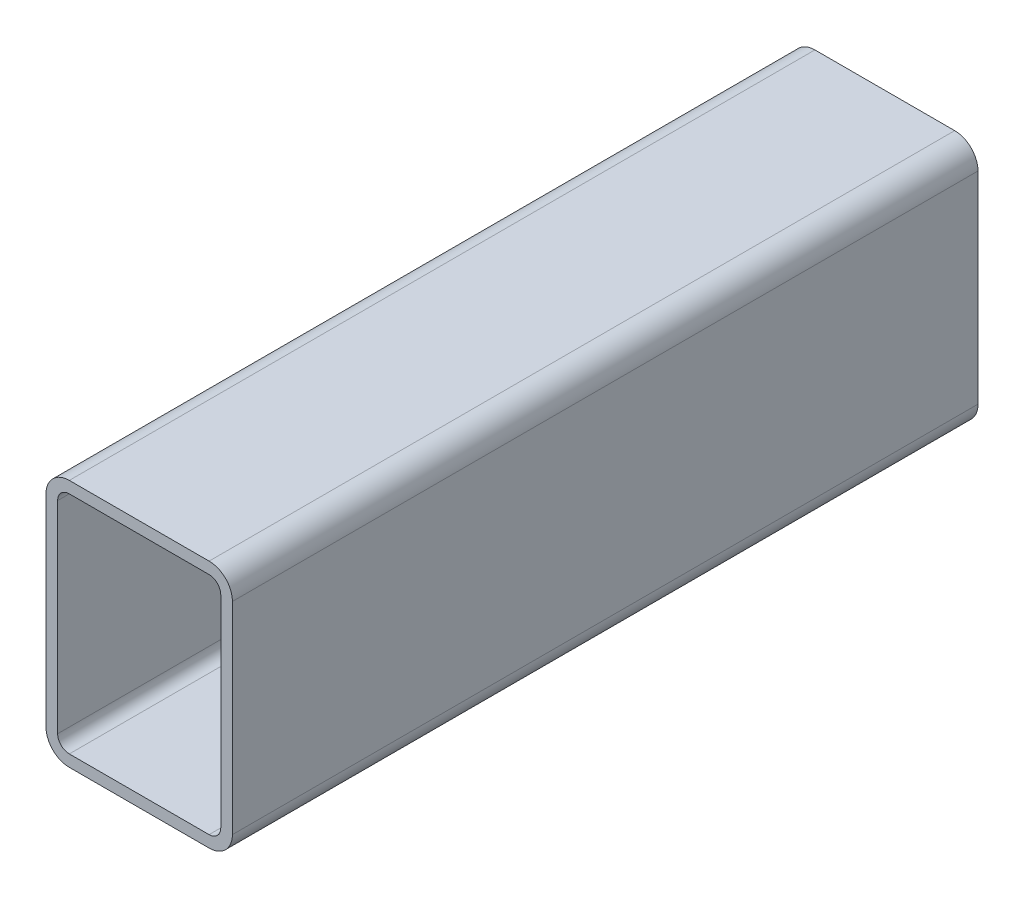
ISO-10303-21;
HEADER;
FILE_DESCRIPTION(('STEP AP214'),'2;1');
FILE_NAME('part.step','',(''),(''),'','','');
FILE_SCHEMA(('AUTOMOTIVE_DESIGN { 1 0 10303 214 1 1 1 1 }'));
ENDSEC;
DATA;
#1=APPLICATION_CONTEXT('core data for automotive mechanical design processes');
#2=APPLICATION_PROTOCOL_DEFINITION('international standard','automotive_design',2000,#1);
#3=PRODUCT_CONTEXT('',#1,'mechanical');
#4=PRODUCT('Part','Part','',(#3));
#5=PRODUCT_RELATED_PRODUCT_CATEGORY('part','',(#4));
#6=PRODUCT_DEFINITION_FORMATION('','',#4);
#7=PRODUCT_DEFINITION_CONTEXT('part definition',#1,'design');
#8=PRODUCT_DEFINITION('design','',#6,#7);
#9=PRODUCT_DEFINITION_SHAPE('','',#8);
#10=(LENGTH_UNIT() NAMED_UNIT(*) SI_UNIT(.MILLI.,.METRE.));
#11=(NAMED_UNIT(*) PLANE_ANGLE_UNIT() SI_UNIT($,.RADIAN.));
#12=(NAMED_UNIT(*) SI_UNIT($,.STERADIAN.) SOLID_ANGLE_UNIT());
#13=UNCERTAINTY_MEASURE_WITH_UNIT(LENGTH_MEASURE(1.E-05),#10,'distance_accuracy_value','');
#14=(GEOMETRIC_REPRESENTATION_CONTEXT(3) GLOBAL_UNCERTAINTY_ASSIGNED_CONTEXT((#13)) GLOBAL_UNIT_ASSIGNED_CONTEXT((#10,
#11,#12)) REPRESENTATION_CONTEXT('',''));
#15=CARTESIAN_POINT('',(0.,0.,0.));
#16=DIRECTION('',(0.,0.,1.));
#17=DIRECTION('',(1.,0.,0.));
#18=AXIS2_PLACEMENT_3D('',#15,#16,#17);
#19=CARTESIAN_POINT('',(12.0141160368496,94.1327651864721,304.8));
#20=DIRECTION('',(0.,0.,1.));
#21=DIRECTION('',(1.,0.,0.));
#22=AXIS2_PLACEMENT_3D('',#19,#20,#21);
#23=PLANE('',#22);
#24=CARTESIAN_POINT('',(12.0141160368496,94.1327651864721,304.8));
#25=DIRECTION('',(0.,0.,1.));
#26=DIRECTION('',(1.,0.,0.));
#27=AXIS2_PLACEMENT_3D('',#24,#25,#26);
#28=CIRCLE('',#27,9.52500000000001);
#29=CARTESIAN_POINT('',(12.0141160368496,103.657765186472,304.8));
#30=VERTEX_POINT('',#29);
#31=CARTESIAN_POINT('',(2.48911603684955,94.1327651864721,304.8));
#32=VERTEX_POINT('',#31);
#33=EDGE_CURVE('E211',#30,#32,#28,.T.);
#34=ORIENTED_EDGE('',*,*,#33,.T.);
#35=DIRECTION('',(0.,-1.,0.));
#36=VECTOR('',#35,1.);
#37=CARTESIAN_POINT('',(2.48911603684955,11.5827651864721,304.8));
#38=LINE('',#37,#36);
#39=CARTESIAN_POINT('',(2.48911603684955,11.5827651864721,304.8));
#40=VERTEX_POINT('',#39);
#41=EDGE_CURVE('E214',#32,#40,#38,.T.);
#42=ORIENTED_EDGE('',*,*,#41,.T.);
#43=CARTESIAN_POINT('',(12.0141160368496,11.5827651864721,304.8));
#44=DIRECTION('',(0.,0.,1.));
#45=DIRECTION('',(1.,0.,0.));
#46=AXIS2_PLACEMENT_3D('',#43,#44,#45);
#47=CIRCLE('',#46,9.525);
#48=CARTESIAN_POINT('',(12.0141160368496,2.05776518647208,304.8));
#49=VERTEX_POINT('',#48);
#50=EDGE_CURVE('E217',#40,#49,#47,.T.);
#51=ORIENTED_EDGE('',*,*,#50,.T.);
#52=DIRECTION('',(1.,0.,0.));
#53=VECTOR('',#52,1.);
#54=CARTESIAN_POINT('',(69.1641160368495,2.05776518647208,304.8));
#55=LINE('',#54,#53);
#56=CARTESIAN_POINT('',(69.1641160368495,2.05776518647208,304.8));
#57=VERTEX_POINT('',#56);
#58=EDGE_CURVE('E219',#49,#57,#55,.T.);
#59=ORIENTED_EDGE('',*,*,#58,.T.);
#60=CARTESIAN_POINT('',(69.1641160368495,11.5827651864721,304.8));
#61=DIRECTION('',(0.,0.,1.));
#62=DIRECTION('',(1.,0.,0.));
#63=AXIS2_PLACEMENT_3D('',#60,#61,#62);
#64=CIRCLE('',#63,9.525);
#65=CARTESIAN_POINT('',(78.6891160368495,11.5827651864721,304.8));
#66=VERTEX_POINT('',#65);
#67=EDGE_CURVE('E221',#57,#66,#64,.T.);
#68=ORIENTED_EDGE('',*,*,#67,.T.);
#69=DIRECTION('',(0.,1.,0.));
#70=VECTOR('',#69,1.);
#71=CARTESIAN_POINT('',(78.6891160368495,94.1327651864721,304.8));
#72=LINE('',#71,#70);
#73=CARTESIAN_POINT('',(78.6891160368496,94.1327651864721,304.8));
#74=VERTEX_POINT('',#73);
#75=EDGE_CURVE('E223',#66,#74,#72,.T.);
#76=ORIENTED_EDGE('',*,*,#75,.T.);
#77=CARTESIAN_POINT('',(69.1641160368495,94.1327651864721,304.8));
#78=DIRECTION('',(0.,0.,1.));
#79=DIRECTION('',(1.,0.,0.));
#80=AXIS2_PLACEMENT_3D('',#77,#78,#79);
#81=CIRCLE('',#80,9.525);
#82=CARTESIAN_POINT('',(69.1641160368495,103.657765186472,304.8));
#83=VERTEX_POINT('',#82);
#84=EDGE_CURVE('E225',#74,#83,#81,.T.);
#85=ORIENTED_EDGE('',*,*,#84,.T.);
#86=DIRECTION('',(-1.,0.,0.));
#87=VECTOR('',#86,1.);
#88=CARTESIAN_POINT('',(12.0141160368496,103.657765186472,304.8));
#89=LINE('',#88,#87);
#90=EDGE_CURVE('E227',#83,#30,#89,.T.);
#91=ORIENTED_EDGE('',*,*,#90,.T.);
#92=EDGE_LOOP('',(#34,#42,#51,#59,#68,#76,#85,#91));
#93=FACE_BOUND('',#92,.T.);
#94=DIRECTION('',(0.,-1.,0.));
#95=VECTOR('',#94,1.);
#96=CARTESIAN_POINT('',(7.25161603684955,11.5827651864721,304.8));
#97=LINE('',#96,#95);
#98=CARTESIAN_POINT('',(7.25161603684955,94.1327651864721,304.8));
#99=VERTEX_POINT('',#98);
#100=CARTESIAN_POINT('',(7.25161603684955,11.5827651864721,304.8));
#101=VERTEX_POINT('',#100);
#102=EDGE_CURVE('E154',#99,#101,#97,.T.);
#103=ORIENTED_EDGE('',*,*,#102,.F.);
#104=CARTESIAN_POINT('',(12.0141160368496,94.1327651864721,304.8));
#105=DIRECTION('',(0.,0.,1.));
#106=DIRECTION('',(1.,0.,0.));
#107=AXIS2_PLACEMENT_3D('',#104,#105,#106);
#108=CIRCLE('',#107,4.7625);
#109=CARTESIAN_POINT('',(12.0141160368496,98.8952651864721,304.8));
#110=VERTEX_POINT('',#109);
#111=EDGE_CURVE('E146',#110,#99,#108,.T.);
#112=ORIENTED_EDGE('',*,*,#111,.F.);
#113=DIRECTION('',(-1.,0.,0.));
#114=VECTOR('',#113,1.);
#115=CARTESIAN_POINT('',(12.0141160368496,98.8952651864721,304.8));
#116=LINE('',#115,#114);
#117=CARTESIAN_POINT('',(69.1641160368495,98.8952651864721,304.8));
#118=VERTEX_POINT('',#117);
#119=EDGE_CURVE('E179',#118,#110,#116,.T.);
#120=ORIENTED_EDGE('',*,*,#119,.F.);
#121=CARTESIAN_POINT('',(69.1641160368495,94.1327651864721,304.8));
#122=DIRECTION('',(0.,0.,1.));
#123=DIRECTION('',(1.,0.,0.));
#124=AXIS2_PLACEMENT_3D('',#121,#122,#123);
#125=CIRCLE('',#124,4.7625);
#126=CARTESIAN_POINT('',(73.9266160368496,94.1327651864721,304.8));
#127=VERTEX_POINT('',#126);
#128=EDGE_CURVE('E177',#127,#118,#125,.T.);
#129=ORIENTED_EDGE('',*,*,#128,.F.);
#130=DIRECTION('',(0.,1.,0.));
#131=VECTOR('',#130,1.);
#132=CARTESIAN_POINT('',(73.9266160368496,94.1327651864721,304.8));
#133=LINE('',#132,#131);
#134=CARTESIAN_POINT('',(73.9266160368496,11.5827651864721,304.8));
#135=VERTEX_POINT('',#134);
#136=EDGE_CURVE('E175',#135,#127,#133,.T.);
#137=ORIENTED_EDGE('',*,*,#136,.F.);
#138=CARTESIAN_POINT('',(69.1641160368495,11.5827651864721,304.8));
#139=DIRECTION('',(0.,0.,1.));
#140=DIRECTION('',(1.,0.,0.));
#141=AXIS2_PLACEMENT_3D('',#138,#139,#140);
#142=CIRCLE('',#141,4.7625);
#143=CARTESIAN_POINT('',(69.1641160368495,6.82026518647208,304.8));
#144=VERTEX_POINT('',#143);
#145=EDGE_CURVE('E173',#144,#135,#142,.T.);
#146=ORIENTED_EDGE('',*,*,#145,.F.);
#147=DIRECTION('',(1.,0.,0.));
#148=VECTOR('',#147,1.);
#149=CARTESIAN_POINT('',(69.1641160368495,6.82026518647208,304.8));
#150=LINE('',#149,#148);
#151=CARTESIAN_POINT('',(12.0141160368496,6.82026518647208,304.8));
#152=VERTEX_POINT('',#151);
#153=EDGE_CURVE('E169',#152,#144,#150,.T.);
#154=ORIENTED_EDGE('',*,*,#153,.F.);
#155=CARTESIAN_POINT('',(12.0141160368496,11.5827651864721,304.8));
#156=DIRECTION('',(0.,0.,1.));
#157=DIRECTION('',(1.,0.,0.));
#158=AXIS2_PLACEMENT_3D('',#155,#156,#157);
#159=CIRCLE('',#158,4.7625);
#160=EDGE_CURVE('E167',#101,#152,#159,.T.);
#161=ORIENTED_EDGE('',*,*,#160,.F.);
#162=EDGE_LOOP('',(#103,#112,#120,#129,#137,#146,#154,#161));
#163=FACE_BOUND('',#162,.T.);
#164=ADVANCED_FACE('F33',(#93,#163),#23,.T.);
#165=CARTESIAN_POINT('',(12.0141160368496,94.1327651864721,0.));
#166=DIRECTION('',(0.,0.,1.));
#167=DIRECTION('',(1.,0.,0.));
#168=AXIS2_PLACEMENT_3D('',#165,#166,#167);
#169=PLANE('',#168);
#170=CARTESIAN_POINT('',(12.0141160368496,94.1327651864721,0.));
#171=DIRECTION('',(0.,0.,1.));
#172=DIRECTION('',(1.,0.,0.));
#173=AXIS2_PLACEMENT_3D('',#170,#171,#172);
#174=CIRCLE('',#173,9.52500000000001);
#175=CARTESIAN_POINT('',(12.0141160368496,103.657765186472,0.));
#176=VERTEX_POINT('',#175);
#177=CARTESIAN_POINT('',(2.48911603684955,94.1327651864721,0.));
#178=VERTEX_POINT('',#177);
#179=EDGE_CURVE('E162',#176,#178,#174,.T.);
#180=ORIENTED_EDGE('',*,*,#179,.F.);
#181=DIRECTION('',(-1.,0.,0.));
#182=VECTOR('',#181,1.);
#183=CARTESIAN_POINT('',(12.0141160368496,103.657765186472,0.));
#184=LINE('',#183,#182);
#185=CARTESIAN_POINT('',(69.1641160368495,103.657765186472,0.));
#186=VERTEX_POINT('',#185);
#187=EDGE_CURVE('E215',#186,#176,#184,.T.);
#188=ORIENTED_EDGE('',*,*,#187,.F.);
#189=CARTESIAN_POINT('',(69.1641160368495,94.1327651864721,0.));
#190=DIRECTION('',(0.,0.,1.));
#191=DIRECTION('',(1.,0.,0.));
#192=AXIS2_PLACEMENT_3D('',#189,#190,#191);
#193=CIRCLE('',#192,9.525);
#194=CARTESIAN_POINT('',(78.6891160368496,94.1327651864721,0.));
#195=VERTEX_POINT('',#194);
#196=EDGE_CURVE('E242',#195,#186,#193,.T.);
#197=ORIENTED_EDGE('',*,*,#196,.F.);
#198=DIRECTION('',(0.,1.,0.));
#199=VECTOR('',#198,1.);
#200=CARTESIAN_POINT('',(78.6891160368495,94.1327651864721,0.));
#201=LINE('',#200,#199);
#202=CARTESIAN_POINT('',(78.6891160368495,11.5827651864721,0.));
#203=VERTEX_POINT('',#202);
#204=EDGE_CURVE('E240',#203,#195,#201,.T.);
#205=ORIENTED_EDGE('',*,*,#204,.F.);
#206=CARTESIAN_POINT('',(69.1641160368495,11.5827651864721,0.));
#207=DIRECTION('',(0.,0.,1.));
#208=DIRECTION('',(1.,0.,0.));
#209=AXIS2_PLACEMENT_3D('',#206,#207,#208);
#210=CIRCLE('',#209,9.525);
#211=CARTESIAN_POINT('',(69.1641160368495,2.05776518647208,0.));
#212=VERTEX_POINT('',#211);
#213=EDGE_CURVE('E238',#212,#203,#210,.T.);
#214=ORIENTED_EDGE('',*,*,#213,.F.);
#215=DIRECTION('',(1.,0.,0.));
#216=VECTOR('',#215,1.);
#217=CARTESIAN_POINT('',(69.1641160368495,2.05776518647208,0.));
#218=LINE('',#217,#216);
#219=CARTESIAN_POINT('',(12.0141160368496,2.05776518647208,0.));
#220=VERTEX_POINT('',#219);
#221=EDGE_CURVE('E236',#220,#212,#218,.T.);
#222=ORIENTED_EDGE('',*,*,#221,.F.);
#223=CARTESIAN_POINT('',(12.0141160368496,11.5827651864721,0.));
#224=DIRECTION('',(0.,0.,1.));
#225=DIRECTION('',(1.,0.,0.));
#226=AXIS2_PLACEMENT_3D('',#223,#224,#225);
#227=CIRCLE('',#226,9.525);
#228=CARTESIAN_POINT('',(2.48911603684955,11.5827651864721,0.));
#229=VERTEX_POINT('',#228);
#230=EDGE_CURVE('E234',#229,#220,#227,.T.);
#231=ORIENTED_EDGE('',*,*,#230,.F.);
#232=DIRECTION('',(0.,-1.,0.));
#233=VECTOR('',#232,1.);
#234=CARTESIAN_POINT('',(2.48911603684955,11.5827651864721,0.));
#235=LINE('',#234,#233);
#236=EDGE_CURVE('E232',#178,#229,#235,.T.);
#237=ORIENTED_EDGE('',*,*,#236,.F.);
#238=EDGE_LOOP('',(#180,#188,#197,#205,#214,#222,#231,#237));
#239=FACE_BOUND('',#238,.T.);
#240=CARTESIAN_POINT('',(12.0141160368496,94.1327651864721,0.));
#241=DIRECTION('',(0.,0.,1.));
#242=DIRECTION('',(1.,0.,0.));
#243=AXIS2_PLACEMENT_3D('',#240,#241,#242);
#244=CIRCLE('',#243,4.7625);
#245=CARTESIAN_POINT('',(12.0141160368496,98.8952651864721,0.));
#246=VERTEX_POINT('',#245);
#247=CARTESIAN_POINT('',(7.25161603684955,94.1327651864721,0.));
#248=VERTEX_POINT('',#247);
#249=EDGE_CURVE('E56',#246,#248,#244,.T.);
#250=ORIENTED_EDGE('',*,*,#249,.T.);
#251=DIRECTION('',(0.,-1.,0.));
#252=VECTOR('',#251,1.);
#253=CARTESIAN_POINT('',(7.25161603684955,11.5827651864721,0.));
#254=LINE('',#253,#252);
#255=CARTESIAN_POINT('',(7.25161603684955,11.5827651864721,0.));
#256=VERTEX_POINT('',#255);
#257=EDGE_CURVE('E161',#248,#256,#254,.T.);
#258=ORIENTED_EDGE('',*,*,#257,.T.);
#259=CARTESIAN_POINT('',(12.0141160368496,11.5827651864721,0.));
#260=DIRECTION('',(0.,0.,1.));
#261=DIRECTION('',(1.,0.,0.));
#262=AXIS2_PLACEMENT_3D('',#259,#260,#261);
#263=CIRCLE('',#262,4.7625);
#264=CARTESIAN_POINT('',(12.0141160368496,6.82026518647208,0.));
#265=VERTEX_POINT('',#264);
#266=EDGE_CURVE('E183',#256,#265,#263,.T.);
#267=ORIENTED_EDGE('',*,*,#266,.T.);
#268=DIRECTION('',(1.,0.,0.));
#269=VECTOR('',#268,1.);
#270=CARTESIAN_POINT('',(69.1641160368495,6.82026518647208,0.));
#271=LINE('',#270,#269);
#272=CARTESIAN_POINT('',(69.1641160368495,6.82026518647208,0.));
#273=VERTEX_POINT('',#272);
#274=EDGE_CURVE('E186',#265,#273,#271,.T.);
#275=ORIENTED_EDGE('',*,*,#274,.T.);
#276=CARTESIAN_POINT('',(69.1641160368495,11.5827651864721,0.));
#277=DIRECTION('',(0.,0.,1.));
#278=DIRECTION('',(1.,0.,0.));
#279=AXIS2_PLACEMENT_3D('',#276,#277,#278);
#280=CIRCLE('',#279,4.7625);
#281=CARTESIAN_POINT('',(73.9266160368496,11.5827651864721,0.));
#282=VERTEX_POINT('',#281);
#283=EDGE_CURVE('E189',#273,#282,#280,.T.);
#284=ORIENTED_EDGE('',*,*,#283,.T.);
#285=DIRECTION('',(0.,1.,0.));
#286=VECTOR('',#285,1.);
#287=CARTESIAN_POINT('',(73.9266160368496,94.1327651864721,0.));
#288=LINE('',#287,#286);
#289=CARTESIAN_POINT('',(73.9266160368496,94.1327651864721,0.));
#290=VERTEX_POINT('',#289);
#291=EDGE_CURVE('E192',#282,#290,#288,.T.);
#292=ORIENTED_EDGE('',*,*,#291,.T.);
#293=CARTESIAN_POINT('',(69.1641160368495,94.1327651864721,0.));
#294=DIRECTION('',(0.,0.,1.));
#295=DIRECTION('',(1.,0.,0.));
#296=AXIS2_PLACEMENT_3D('',#293,#294,#295);
#297=CIRCLE('',#296,4.7625);
#298=CARTESIAN_POINT('',(69.1641160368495,98.8952651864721,0.));
#299=VERTEX_POINT('',#298);
#300=EDGE_CURVE('E195',#290,#299,#297,.T.);
#301=ORIENTED_EDGE('',*,*,#300,.T.);
#302=DIRECTION('',(-1.,0.,0.));
#303=VECTOR('',#302,1.);
#304=CARTESIAN_POINT('',(12.0141160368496,98.8952651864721,0.));
#305=LINE('',#304,#303);
#306=EDGE_CURVE('E155',#299,#246,#305,.T.);
#307=ORIENTED_EDGE('',*,*,#306,.T.);
#308=EDGE_LOOP('',(#250,#258,#267,#275,#284,#292,#301,#307));
#309=FACE_BOUND('',#308,.T.);
#310=ADVANCED_FACE('F272',(#239,#309),#169,.F.);
#311=CARTESIAN_POINT('',(12.0141160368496,94.1327651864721,304.8));
#312=DIRECTION('',(0.,0.,-1.));
#313=DIRECTION('',(-1.,0.,0.));
#314=AXIS2_PLACEMENT_3D('',#311,#312,#313);
#315=CYLINDRICAL_SURFACE('',#314,9.52500000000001);
#316=ORIENTED_EDGE('',*,*,#179,.T.);
#317=DIRECTION('',(0.,0.,-1.));
#318=VECTOR('',#317,1.);
#319=CARTESIAN_POINT('',(2.48911603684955,94.1327651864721,304.8));
#320=LINE('',#319,#318);
#321=EDGE_CURVE('E11',#32,#178,#320,.T.);
#322=ORIENTED_EDGE('',*,*,#321,.F.);
#323=ORIENTED_EDGE('',*,*,#33,.F.);
#324=DIRECTION('',(0.,0.,-1.));
#325=VECTOR('',#324,1.);
#326=CARTESIAN_POINT('',(12.0141160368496,103.657765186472,304.8));
#327=LINE('',#326,#325);
#328=EDGE_CURVE('E229',#30,#176,#327,.T.);
#329=ORIENTED_EDGE('',*,*,#328,.T.);
#330=EDGE_LOOP('',(#316,#322,#323,#329));
#331=FACE_BOUND('',#330,.T.);
#332=ADVANCED_FACE('F35',(#331),#315,.T.);
#333=CARTESIAN_POINT('',(2.48911603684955,11.5827651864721,304.8));
#334=DIRECTION('',(1.,0.,0.));
#335=DIRECTION('',(0.,0.,-1.));
#336=AXIS2_PLACEMENT_3D('',#333,#334,#335);
#337=PLANE('',#336);
#338=ORIENTED_EDGE('',*,*,#236,.T.);
#339=DIRECTION('',(0.,0.,-1.));
#340=VECTOR('',#339,1.);
#341=CARTESIAN_POINT('',(2.48911603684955,11.5827651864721,304.8));
#342=LINE('',#341,#340);
#343=EDGE_CURVE('E41',#40,#229,#342,.T.);
#344=ORIENTED_EDGE('',*,*,#343,.F.);
#345=ORIENTED_EDGE('',*,*,#41,.F.);
#346=ORIENTED_EDGE('',*,*,#321,.T.);
#347=EDGE_LOOP('',(#338,#344,#345,#346));
#348=FACE_BOUND('',#347,.T.);
#349=ADVANCED_FACE('F289',(#348),#337,.F.);
#350=CARTESIAN_POINT('',(12.0141160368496,11.5827651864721,304.8));
#351=DIRECTION('',(0.,0.,-1.));
#352=DIRECTION('',(-1.,0.,0.));
#353=AXIS2_PLACEMENT_3D('',#350,#351,#352);
#354=CYLINDRICAL_SURFACE('',#353,9.525);
#355=ORIENTED_EDGE('',*,*,#230,.T.);
#356=DIRECTION('',(0.,0.,-1.));
#357=VECTOR('',#356,1.);
#358=CARTESIAN_POINT('',(12.0141160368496,2.05776518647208,304.8));
#359=LINE('',#358,#357);
#360=EDGE_CURVE('E259',#49,#220,#359,.T.);
#361=ORIENTED_EDGE('',*,*,#360,.F.);
#362=ORIENTED_EDGE('',*,*,#50,.F.);
#363=ORIENTED_EDGE('',*,*,#343,.T.);
#364=EDGE_LOOP('',(#355,#361,#362,#363));
#365=FACE_BOUND('',#364,.T.);
#366=ADVANCED_FACE('F266',(#365),#354,.T.);
#367=CARTESIAN_POINT('',(69.1641160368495,2.05776518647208,304.8));
#368=DIRECTION('',(0.,1.,0.));
#369=DIRECTION('',(0.,0.,1.));
#370=AXIS2_PLACEMENT_3D('',#367,#368,#369);
#371=PLANE('',#370);
#372=ORIENTED_EDGE('',*,*,#221,.T.);
#373=DIRECTION('',(0.,0.,-1.));
#374=VECTOR('',#373,1.);
#375=CARTESIAN_POINT('',(69.1641160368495,2.05776518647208,304.8));
#376=LINE('',#375,#374);
#377=EDGE_CURVE('E256',#57,#212,#376,.T.);
#378=ORIENTED_EDGE('',*,*,#377,.F.);
#379=ORIENTED_EDGE('',*,*,#58,.F.);
#380=ORIENTED_EDGE('',*,*,#360,.T.);
#381=EDGE_LOOP('',(#372,#378,#379,#380));
#382=FACE_BOUND('',#381,.T.);
#383=ADVANCED_FACE('F278',(#382),#371,.F.);
#384=CARTESIAN_POINT('',(69.1641160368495,11.5827651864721,304.8));
#385=DIRECTION('',(0.,0.,-1.));
#386=DIRECTION('',(-1.,0.,0.));
#387=AXIS2_PLACEMENT_3D('',#384,#385,#386);
#388=CYLINDRICAL_SURFACE('',#387,9.525);
#389=ORIENTED_EDGE('',*,*,#213,.T.);
#390=DIRECTION('',(0.,0.,-1.));
#391=VECTOR('',#390,1.);
#392=CARTESIAN_POINT('',(78.6891160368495,11.5827651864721,304.8));
#393=LINE('',#392,#391);
#394=EDGE_CURVE('E253',#66,#203,#393,.T.);
#395=ORIENTED_EDGE('',*,*,#394,.F.);
#396=ORIENTED_EDGE('',*,*,#67,.F.);
#397=ORIENTED_EDGE('',*,*,#377,.T.);
#398=EDGE_LOOP('',(#389,#395,#396,#397));
#399=FACE_BOUND('',#398,.T.);
#400=ADVANCED_FACE('F282',(#399),#388,.T.);
#401=CARTESIAN_POINT('',(78.6891160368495,94.1327651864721,304.8));
#402=DIRECTION('',(-1.,0.,0.));
#403=DIRECTION('',(0.,0.,1.));
#404=AXIS2_PLACEMENT_3D('',#401,#402,#403);
#405=PLANE('',#404);
#406=ORIENTED_EDGE('',*,*,#204,.T.);
#407=DIRECTION('',(0.,0.,-1.));
#408=VECTOR('',#407,1.);
#409=CARTESIAN_POINT('',(78.6891160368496,94.1327651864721,304.8));
#410=LINE('',#409,#408);
#411=EDGE_CURVE('E250',#74,#195,#410,.T.);
#412=ORIENTED_EDGE('',*,*,#411,.F.);
#413=ORIENTED_EDGE('',*,*,#75,.F.);
#414=ORIENTED_EDGE('',*,*,#394,.T.);
#415=EDGE_LOOP('',(#406,#412,#413,#414));
#416=FACE_BOUND('',#415,.T.);
#417=ADVANCED_FACE('F302',(#416),#405,.F.);
#418=CARTESIAN_POINT('',(69.1641160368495,94.1327651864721,304.8));
#419=DIRECTION('',(0.,0.,-1.));
#420=DIRECTION('',(-1.,0.,0.));
#421=AXIS2_PLACEMENT_3D('',#418,#419,#420);
#422=CYLINDRICAL_SURFACE('',#421,9.525);
#423=ORIENTED_EDGE('',*,*,#196,.T.);
#424=DIRECTION('',(0.,0.,-1.));
#425=VECTOR('',#424,1.);
#426=CARTESIAN_POINT('',(69.1641160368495,103.657765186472,304.8));
#427=LINE('',#426,#425);
#428=EDGE_CURVE('E247',#83,#186,#427,.T.);
#429=ORIENTED_EDGE('',*,*,#428,.F.);
#430=ORIENTED_EDGE('',*,*,#84,.F.);
#431=ORIENTED_EDGE('',*,*,#411,.T.);
#432=EDGE_LOOP('',(#423,#429,#430,#431));
#433=FACE_BOUND('',#432,.T.);
#434=ADVANCED_FACE('F300',(#433),#422,.T.);
#435=CARTESIAN_POINT('',(12.0141160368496,103.657765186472,304.8));
#436=DIRECTION('',(0.,-1.,0.));
#437=DIRECTION('',(0.,0.,-1.));
#438=AXIS2_PLACEMENT_3D('',#435,#436,#437);
#439=PLANE('',#438);
#440=ORIENTED_EDGE('',*,*,#187,.T.);
#441=ORIENTED_EDGE('',*,*,#328,.F.);
#442=ORIENTED_EDGE('',*,*,#90,.F.);
#443=ORIENTED_EDGE('',*,*,#428,.T.);
#444=EDGE_LOOP('',(#440,#441,#442,#443));
#445=FACE_BOUND('',#444,.T.);
#446=ADVANCED_FACE('F295',(#445),#439,.F.);
#447=CARTESIAN_POINT('',(12.0141160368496,94.1327651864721,304.8));
#448=DIRECTION('',(0.,0.,-1.));
#449=DIRECTION('',(-1.,0.,0.));
#450=AXIS2_PLACEMENT_3D('',#447,#448,#449);
#451=CYLINDRICAL_SURFACE('',#450,4.7625);
#452=ORIENTED_EDGE('',*,*,#249,.F.);
#453=DIRECTION('',(0.,0.,-1.));
#454=VECTOR('',#453,1.);
#455=CARTESIAN_POINT('',(12.0141160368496,98.8952651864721,304.8));
#456=LINE('',#455,#454);
#457=EDGE_CURVE('E150',#110,#246,#456,.T.);
#458=ORIENTED_EDGE('',*,*,#457,.F.);
#459=ORIENTED_EDGE('',*,*,#111,.T.);
#460=DIRECTION('',(0.,0.,-1.));
#461=VECTOR('',#460,1.);
#462=CARTESIAN_POINT('',(7.25161603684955,94.1327651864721,304.8));
#463=LINE('',#462,#461);
#464=EDGE_CURVE('E149',#99,#248,#463,.T.);
#465=ORIENTED_EDGE('',*,*,#464,.T.);
#466=EDGE_LOOP('',(#452,#458,#459,#465));
#467=FACE_BOUND('',#466,.T.);
#468=ADVANCED_FACE('F148',(#467),#451,.F.);
#469=CARTESIAN_POINT('',(7.25161603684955,11.5827651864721,304.8));
#470=DIRECTION('',(1.,0.,0.));
#471=DIRECTION('',(0.,0.,-1.));
#472=AXIS2_PLACEMENT_3D('',#469,#470,#471);
#473=PLANE('',#472);
#474=ORIENTED_EDGE('',*,*,#257,.F.);
#475=ORIENTED_EDGE('',*,*,#464,.F.);
#476=ORIENTED_EDGE('',*,*,#102,.T.);
#477=DIRECTION('',(0.,0.,-1.));
#478=VECTOR('',#477,1.);
#479=CARTESIAN_POINT('',(7.25161603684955,11.5827651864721,304.8));
#480=LINE('',#479,#478);
#481=EDGE_CURVE('E163',#101,#256,#480,.T.);
#482=ORIENTED_EDGE('',*,*,#481,.T.);
#483=EDGE_LOOP('',(#474,#475,#476,#482));
#484=FACE_BOUND('',#483,.T.);
#485=ADVANCED_FACE('F158',(#484),#473,.T.);
#486=CARTESIAN_POINT('',(12.0141160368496,11.5827651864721,304.8));
#487=DIRECTION('',(0.,0.,-1.));
#488=DIRECTION('',(-1.,0.,0.));
#489=AXIS2_PLACEMENT_3D('',#486,#487,#488);
#490=CYLINDRICAL_SURFACE('',#489,4.7625);
#491=ORIENTED_EDGE('',*,*,#266,.F.);
#492=ORIENTED_EDGE('',*,*,#481,.F.);
#493=ORIENTED_EDGE('',*,*,#160,.T.);
#494=DIRECTION('',(0.,0.,-1.));
#495=VECTOR('',#494,1.);
#496=CARTESIAN_POINT('',(12.0141160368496,6.82026518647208,304.8));
#497=LINE('',#496,#495);
#498=EDGE_CURVE('E208',#152,#265,#497,.T.);
#499=ORIENTED_EDGE('',*,*,#498,.T.);
#500=EDGE_LOOP('',(#491,#492,#493,#499));
#501=FACE_BOUND('',#500,.T.);
#502=ADVANCED_FACE('F327',(#501),#490,.F.);
#503=CARTESIAN_POINT('',(69.1641160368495,6.82026518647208,304.8));
#504=DIRECTION('',(0.,1.,0.));
#505=DIRECTION('',(0.,0.,1.));
#506=AXIS2_PLACEMENT_3D('',#503,#504,#505);
#507=PLANE('',#506);
#508=ORIENTED_EDGE('',*,*,#274,.F.);
#509=ORIENTED_EDGE('',*,*,#498,.F.);
#510=ORIENTED_EDGE('',*,*,#153,.T.);
#511=DIRECTION('',(0.,0.,-1.));
#512=VECTOR('',#511,1.);
#513=CARTESIAN_POINT('',(69.1641160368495,6.82026518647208,304.8));
#514=LINE('',#513,#512);
#515=EDGE_CURVE('E206',#144,#273,#514,.T.);
#516=ORIENTED_EDGE('',*,*,#515,.T.);
#517=EDGE_LOOP('',(#508,#509,#510,#516));
#518=FACE_BOUND('',#517,.T.);
#519=ADVANCED_FACE('F331',(#518),#507,.T.);
#520=CARTESIAN_POINT('',(69.1641160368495,11.5827651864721,304.8));
#521=DIRECTION('',(0.,0.,-1.));
#522=DIRECTION('',(-1.,0.,0.));
#523=AXIS2_PLACEMENT_3D('',#520,#521,#522);
#524=CYLINDRICAL_SURFACE('',#523,4.7625);
#525=ORIENTED_EDGE('',*,*,#283,.F.);
#526=ORIENTED_EDGE('',*,*,#515,.F.);
#527=ORIENTED_EDGE('',*,*,#145,.T.);
#528=DIRECTION('',(0.,0.,-1.));
#529=VECTOR('',#528,1.);
#530=CARTESIAN_POINT('',(73.9266160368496,11.5827651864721,304.8));
#531=LINE('',#530,#529);
#532=EDGE_CURVE('E204',#135,#282,#531,.T.);
#533=ORIENTED_EDGE('',*,*,#532,.T.);
#534=EDGE_LOOP('',(#525,#526,#527,#533));
#535=FACE_BOUND('',#534,.T.);
#536=ADVANCED_FACE('F337',(#535),#524,.F.);
#537=CARTESIAN_POINT('',(73.9266160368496,94.1327651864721,304.8));
#538=DIRECTION('',(-1.,0.,0.));
#539=DIRECTION('',(0.,0.,1.));
#540=AXIS2_PLACEMENT_3D('',#537,#538,#539);
#541=PLANE('',#540);
#542=ORIENTED_EDGE('',*,*,#291,.F.);
#543=ORIENTED_EDGE('',*,*,#532,.F.);
#544=ORIENTED_EDGE('',*,*,#136,.T.);
#545=DIRECTION('',(0.,0.,-1.));
#546=VECTOR('',#545,1.);
#547=CARTESIAN_POINT('',(73.9266160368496,94.1327651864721,304.8));
#548=LINE('',#547,#546);
#549=EDGE_CURVE('E202',#127,#290,#548,.T.);
#550=ORIENTED_EDGE('',*,*,#549,.T.);
#551=EDGE_LOOP('',(#542,#543,#544,#550));
#552=FACE_BOUND('',#551,.T.);
#553=ADVANCED_FACE('F341',(#552),#541,.T.);
#554=CARTESIAN_POINT('',(69.1641160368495,94.1327651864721,304.8));
#555=DIRECTION('',(0.,0.,-1.));
#556=DIRECTION('',(-1.,0.,0.));
#557=AXIS2_PLACEMENT_3D('',#554,#555,#556);
#558=CYLINDRICAL_SURFACE('',#557,4.7625);
#559=ORIENTED_EDGE('',*,*,#300,.F.);
#560=ORIENTED_EDGE('',*,*,#549,.F.);
#561=ORIENTED_EDGE('',*,*,#128,.T.);
#562=DIRECTION('',(0.,0.,-1.));
#563=VECTOR('',#562,1.);
#564=CARTESIAN_POINT('',(69.1641160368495,98.8952651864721,304.8));
#565=LINE('',#564,#563);
#566=EDGE_CURVE('E48',#118,#299,#565,.T.);
#567=ORIENTED_EDGE('',*,*,#566,.T.);
#568=EDGE_LOOP('',(#559,#560,#561,#567));
#569=FACE_BOUND('',#568,.T.);
#570=ADVANCED_FACE('F345',(#569),#558,.F.);
#571=CARTESIAN_POINT('',(12.0141160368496,98.8952651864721,304.8));
#572=DIRECTION('',(0.,-1.,0.));
#573=DIRECTION('',(0.,0.,-1.));
#574=AXIS2_PLACEMENT_3D('',#571,#572,#573);
#575=PLANE('',#574);
#576=ORIENTED_EDGE('',*,*,#306,.F.);
#577=ORIENTED_EDGE('',*,*,#566,.F.);
#578=ORIENTED_EDGE('',*,*,#119,.T.);
#579=ORIENTED_EDGE('',*,*,#457,.T.);
#580=EDGE_LOOP('',(#576,#577,#578,#579));
#581=FACE_BOUND('',#580,.T.);
#582=ADVANCED_FACE('F349',(#581),#575,.T.);
#583=CLOSED_SHELL('',(#164,#310,#332,#349,#366,#383,#400,#417,#434,#446,#468,#485,#502,#519,
#536,#553,#570,#582));
#584=MANIFOLD_SOLID_BREP('B2',#583);
#585=ADVANCED_BREP_SHAPE_REPRESENTATION('',(#18,#584),#14);
#586=SHAPE_DEFINITION_REPRESENTATION(#9,#585);
ENDSEC;
END-ISO-10303-21;
